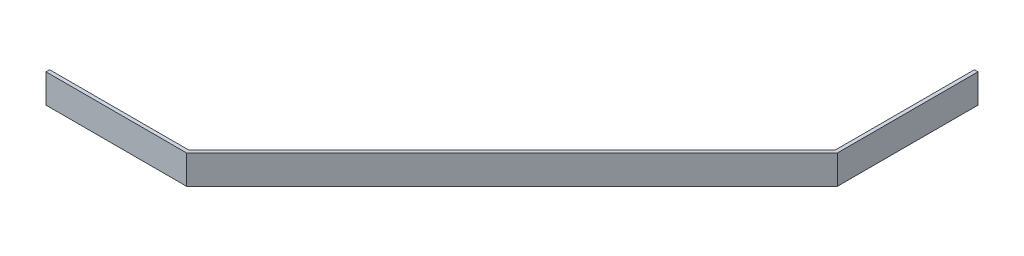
ISO-10303-21;
HEADER;
FILE_DESCRIPTION(('STEP AP214'),'2;1');
FILE_NAME('part.step','',(''),(''),'','','');
FILE_SCHEMA(('AUTOMOTIVE_DESIGN { 1 0 10303 214 1 1 1 1 }'));
ENDSEC;
DATA;
#1=APPLICATION_CONTEXT('core data for automotive mechanical design processes');
#2=APPLICATION_PROTOCOL_DEFINITION('international standard','automotive_design',2000,#1);
#3=PRODUCT_CONTEXT('',#1,'mechanical');
#4=PRODUCT('Part','Part','',(#3));
#5=PRODUCT_RELATED_PRODUCT_CATEGORY('part','',(#4));
#6=PRODUCT_DEFINITION_FORMATION('','',#4);
#7=PRODUCT_DEFINITION_CONTEXT('part definition',#1,'design');
#8=PRODUCT_DEFINITION('design','',#6,#7);
#9=PRODUCT_DEFINITION_SHAPE('','',#8);
#10=(LENGTH_UNIT() NAMED_UNIT(*) SI_UNIT(.MILLI.,.METRE.));
#11=(NAMED_UNIT(*) PLANE_ANGLE_UNIT() SI_UNIT($,.RADIAN.));
#12=(NAMED_UNIT(*) SI_UNIT($,.STERADIAN.) SOLID_ANGLE_UNIT());
#13=UNCERTAINTY_MEASURE_WITH_UNIT(LENGTH_MEASURE(1.E-05),#10,'distance_accuracy_value','');
#14=(GEOMETRIC_REPRESENTATION_CONTEXT(3) GLOBAL_UNCERTAINTY_ASSIGNED_CONTEXT((#13)) GLOBAL_UNIT_ASSIGNED_CONTEXT((#10,
#11,#12)) REPRESENTATION_CONTEXT('',''));
#15=CARTESIAN_POINT('',(0.,0.,0.));
#16=DIRECTION('',(0.,0.,1.));
#17=DIRECTION('',(1.,0.,0.));
#18=AXIS2_PLACEMENT_3D('',#15,#16,#17);
#19=CARTESIAN_POINT('',(0.,76.2,0.));
#20=DIRECTION('',(1.,0.,0.));
#21=DIRECTION('',(0.,0.,-1.));
#22=AXIS2_PLACEMENT_3D('',#19,#20,#21);
#23=PLANE('',#22);
#24=DIRECTION('',(0.,0.,1.));
#25=VECTOR('',#24,1.);
#26=CARTESIAN_POINT('',(0.,0.,0.));
#27=LINE('',#26,#25);
#28=CARTESIAN_POINT('',(0.,0.,0.));
#29=VERTEX_POINT('',#28);
#30=CARTESIAN_POINT('',(0.,0.,9.525));
#31=VERTEX_POINT('',#30);
#32=EDGE_CURVE('E129',#29,#31,#27,.T.);
#33=ORIENTED_EDGE('',*,*,#32,.T.);
#34=DIRECTION('',(0.,-1.,0.));
#35=VECTOR('',#34,1.);
#36=CARTESIAN_POINT('',(0.,76.2,9.525));
#37=LINE('',#36,#35);
#38=CARTESIAN_POINT('',(0.,76.2,9.525));
#39=VERTEX_POINT('',#38);
#40=EDGE_CURVE('E11',#39,#31,#37,.T.);
#41=ORIENTED_EDGE('',*,*,#40,.F.);
#42=DIRECTION('',(0.,0.,1.));
#43=VECTOR('',#42,1.);
#44=CARTESIAN_POINT('',(0.,76.2,0.));
#45=LINE('',#44,#43);
#46=CARTESIAN_POINT('',(0.,76.2,0.));
#47=VERTEX_POINT('',#46);
#48=EDGE_CURVE('E143',#47,#39,#45,.T.);
#49=ORIENTED_EDGE('',*,*,#48,.F.);
#50=DIRECTION('',(0.,-1.,0.));
#51=VECTOR('',#50,1.);
#52=CARTESIAN_POINT('',(0.,76.2,0.));
#53=LINE('',#52,#51);
#54=EDGE_CURVE('E125',#47,#29,#53,.T.);
#55=ORIENTED_EDGE('',*,*,#54,.T.);
#56=EDGE_LOOP('',(#33,#41,#49,#55));
#57=FACE_BOUND('',#56,.T.);
#58=ADVANCED_FACE('F33',(#57),#23,.F.);
#59=CARTESIAN_POINT('',(0.,76.2,9.525));
#60=DIRECTION('',(0.,0.,-1.));
#61=DIRECTION('',(-1.,0.,0.));
#62=AXIS2_PLACEMENT_3D('',#59,#60,#61);
#63=PLANE('',#62);
#64=DIRECTION('',(1.,0.,0.));
#65=VECTOR('',#64,1.);
#66=CARTESIAN_POINT('',(0.,0.,9.525));
#67=LINE('',#66,#65);
#68=CARTESIAN_POINT('',(370.657884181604,0.,9.52500000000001));
#69=VERTEX_POINT('',#68);
#70=EDGE_CURVE('E132',#31,#69,#67,.T.);
#71=ORIENTED_EDGE('',*,*,#70,.T.);
#72=DIRECTION('',(0.,-1.,0.));
#73=VECTOR('',#72,1.);
#74=CARTESIAN_POINT('',(370.657884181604,76.2,9.52500000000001));
#75=LINE('',#74,#73);
#76=CARTESIAN_POINT('',(370.657884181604,76.2,9.52500000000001));
#77=VERTEX_POINT('',#76);
#78=EDGE_CURVE('E41',#77,#69,#75,.T.);
#79=ORIENTED_EDGE('',*,*,#78,.F.);
#80=DIRECTION('',(1.,0.,0.));
#81=VECTOR('',#80,1.);
#82=CARTESIAN_POINT('',(0.,76.2,9.525));
#83=LINE('',#82,#81);
#84=EDGE_CURVE('E92',#39,#77,#83,.T.);
#85=ORIENTED_EDGE('',*,*,#84,.F.);
#86=ORIENTED_EDGE('',*,*,#40,.T.);
#87=EDGE_LOOP('',(#71,#79,#85,#86));
#88=FACE_BOUND('',#87,.T.);
#89=ADVANCED_FACE('F178',(#88),#63,.F.);
#90=CARTESIAN_POINT('',(370.657884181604,76.2,9.52500000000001));
#91=DIRECTION('',(-0.707106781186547,0.,-0.707106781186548));
#92=DIRECTION('',(-0.707106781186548,0.,0.707106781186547));
#93=AXIS2_PLACEMENT_3D('',#90,#91,#92);
#94=PLANE('',#93);
#95=DIRECTION('',(0.707106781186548,0.,-0.707106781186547));
#96=VECTOR('',#95,1.);
#97=CARTESIAN_POINT('',(370.657884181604,0.,9.52500000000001));
#98=LINE('',#97,#96);
#99=CARTESIAN_POINT('',(1228.725,0.,-848.542115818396));
#100=VERTEX_POINT('',#99);
#101=EDGE_CURVE('E134',#69,#100,#98,.T.);
#102=ORIENTED_EDGE('',*,*,#101,.T.);
#103=DIRECTION('',(0.,-1.,0.));
#104=VECTOR('',#103,1.);
#105=CARTESIAN_POINT('',(1228.725,76.2,-848.542115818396));
#106=LINE('',#105,#104);
#107=CARTESIAN_POINT('',(1228.725,76.2,-848.542115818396));
#108=VERTEX_POINT('',#107);
#109=EDGE_CURVE('E150',#108,#100,#106,.T.);
#110=ORIENTED_EDGE('',*,*,#109,.F.);
#111=DIRECTION('',(0.707106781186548,0.,-0.707106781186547));
#112=VECTOR('',#111,1.);
#113=CARTESIAN_POINT('',(370.657884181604,76.2,9.52500000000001));
#114=LINE('',#113,#112);
#115=EDGE_CURVE('E158',#77,#108,#114,.T.);
#116=ORIENTED_EDGE('',*,*,#115,.F.);
#117=ORIENTED_EDGE('',*,*,#78,.T.);
#118=EDGE_LOOP('',(#102,#110,#116,#117));
#119=FACE_BOUND('',#118,.T.);
#120=ADVANCED_FACE('F156',(#119),#94,.F.);
#121=CARTESIAN_POINT('',(1228.725,76.2,-848.542115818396));
#122=DIRECTION('',(-1.,0.,0.));
#123=DIRECTION('',(0.,0.,1.));
#124=AXIS2_PLACEMENT_3D('',#121,#122,#123);
#125=PLANE('',#124);
#126=DIRECTION('',(0.,0.,-1.));
#127=VECTOR('',#126,1.);
#128=CARTESIAN_POINT('',(1228.725,0.,-848.542115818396));
#129=LINE('',#128,#127);
#130=CARTESIAN_POINT('',(1228.725,0.,-1219.2));
#131=VERTEX_POINT('',#130);
#132=EDGE_CURVE('E136',#100,#131,#129,.T.);
#133=ORIENTED_EDGE('',*,*,#132,.T.);
#134=DIRECTION('',(0.,-1.,0.));
#135=VECTOR('',#134,1.);
#136=CARTESIAN_POINT('',(1228.725,76.2,-1219.2));
#137=LINE('',#136,#135);
#138=CARTESIAN_POINT('',(1228.725,76.2,-1219.2));
#139=VERTEX_POINT('',#138);
#140=EDGE_CURVE('E147',#139,#131,#137,.T.);
#141=ORIENTED_EDGE('',*,*,#140,.F.);
#142=DIRECTION('',(0.,0.,-1.));
#143=VECTOR('',#142,1.);
#144=CARTESIAN_POINT('',(1228.725,76.2,-848.542115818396));
#145=LINE('',#144,#143);
#146=EDGE_CURVE('E170',#108,#139,#145,.T.);
#147=ORIENTED_EDGE('',*,*,#146,.F.);
#148=ORIENTED_EDGE('',*,*,#109,.T.);
#149=EDGE_LOOP('',(#133,#141,#147,#148));
#150=FACE_BOUND('',#149,.T.);
#151=ADVANCED_FACE('F166',(#150),#125,.F.);
#152=CARTESIAN_POINT('',(1219.2,76.2,-1219.2));
#153=DIRECTION('',(0.,0.,1.));
#154=DIRECTION('',(1.,0.,0.));
#155=AXIS2_PLACEMENT_3D('',#152,#153,#154);
#156=PLANE('',#155);
#157=DIRECTION('',(-1.,0.,0.));
#158=VECTOR('',#157,1.);
#159=CARTESIAN_POINT('',(1219.2,0.,-1219.2));
#160=LINE('',#159,#158);
#161=CARTESIAN_POINT('',(1219.2,0.,-1219.2));
#162=VERTEX_POINT('',#161);
#163=EDGE_CURVE('E138',#131,#162,#160,.T.);
#164=ORIENTED_EDGE('',*,*,#163,.T.);
#165=DIRECTION('',(0.,-1.,0.));
#166=VECTOR('',#165,1.);
#167=CARTESIAN_POINT('',(1219.2,76.2,-1219.2));
#168=LINE('',#167,#166);
#169=CARTESIAN_POINT('',(1219.2,76.2,-1219.2));
#170=VERTEX_POINT('',#169);
#171=EDGE_CURVE('E120',#170,#162,#168,.T.);
#172=ORIENTED_EDGE('',*,*,#171,.F.);
#173=DIRECTION('',(-1.,0.,0.));
#174=VECTOR('',#173,1.);
#175=CARTESIAN_POINT('',(1219.2,76.2,-1219.2));
#176=LINE('',#175,#174);
#177=EDGE_CURVE('E111',#139,#170,#176,.T.);
#178=ORIENTED_EDGE('',*,*,#177,.F.);
#179=ORIENTED_EDGE('',*,*,#140,.T.);
#180=EDGE_LOOP('',(#164,#172,#178,#179));
#181=FACE_BOUND('',#180,.T.);
#182=ADVANCED_FACE('F169',(#181),#156,.F.);
#183=CARTESIAN_POINT('',(1219.2,76.2,-852.4875));
#184=DIRECTION('',(1.,0.,0.));
#185=DIRECTION('',(0.,0.,-1.));
#186=AXIS2_PLACEMENT_3D('',#183,#184,#185);
#187=PLANE('',#186);
#188=DIRECTION('',(0.,0.,1.));
#189=VECTOR('',#188,1.);
#190=CARTESIAN_POINT('',(1219.2,0.,-852.4875));
#191=LINE('',#190,#189);
#192=CARTESIAN_POINT('',(1219.2,0.,-852.4875));
#193=VERTEX_POINT('',#192);
#194=EDGE_CURVE('E119',#162,#193,#191,.T.);
#195=ORIENTED_EDGE('',*,*,#194,.T.);
#196=DIRECTION('',(0.,-1.,0.));
#197=VECTOR('',#196,1.);
#198=CARTESIAN_POINT('',(1219.2,76.2,-852.4875));
#199=LINE('',#198,#197);
#200=CARTESIAN_POINT('',(1219.2,76.2,-852.4875));
#201=VERTEX_POINT('',#200);
#202=EDGE_CURVE('E116',#201,#193,#199,.T.);
#203=ORIENTED_EDGE('',*,*,#202,.F.);
#204=DIRECTION('',(0.,0.,1.));
#205=VECTOR('',#204,1.);
#206=CARTESIAN_POINT('',(1219.2,76.2,-852.4875));
#207=LINE('',#206,#205);
#208=EDGE_CURVE('E105',#170,#201,#207,.T.);
#209=ORIENTED_EDGE('',*,*,#208,.F.);
#210=ORIENTED_EDGE('',*,*,#171,.T.);
#211=EDGE_LOOP('',(#195,#203,#209,#210));
#212=FACE_BOUND('',#211,.T.);
#213=ADVANCED_FACE('F117',(#212),#187,.F.);
#214=CARTESIAN_POINT('',(366.7125,76.2,0.));
#215=DIRECTION('',(0.707106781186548,0.,0.707106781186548));
#216=DIRECTION('',(0.707106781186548,0.,-0.707106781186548));
#217=AXIS2_PLACEMENT_3D('',#214,#215,#216);
#218=PLANE('',#217);
#219=DIRECTION('',(-0.707106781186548,0.,0.707106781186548));
#220=VECTOR('',#219,1.);
#221=CARTESIAN_POINT('',(366.7125,0.,0.));
#222=LINE('',#221,#220);
#223=CARTESIAN_POINT('',(366.7125,0.,0.));
#224=VERTEX_POINT('',#223);
#225=EDGE_CURVE('E78',#193,#224,#222,.T.);
#226=ORIENTED_EDGE('',*,*,#225,.T.);
#227=DIRECTION('',(0.,-1.,0.));
#228=VECTOR('',#227,1.);
#229=CARTESIAN_POINT('',(366.7125,76.2,0.));
#230=LINE('',#229,#228);
#231=CARTESIAN_POINT('',(366.7125,76.2,0.));
#232=VERTEX_POINT('',#231);
#233=EDGE_CURVE('E121',#232,#224,#230,.T.);
#234=ORIENTED_EDGE('',*,*,#233,.F.);
#235=DIRECTION('',(-0.707106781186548,0.,0.707106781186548));
#236=VECTOR('',#235,1.);
#237=CARTESIAN_POINT('',(366.7125,76.2,0.));
#238=LINE('',#237,#236);
#239=EDGE_CURVE('E109',#201,#232,#238,.T.);
#240=ORIENTED_EDGE('',*,*,#239,.F.);
#241=ORIENTED_EDGE('',*,*,#202,.T.);
#242=EDGE_LOOP('',(#226,#234,#240,#241));
#243=FACE_BOUND('',#242,.T.);
#244=ADVANCED_FACE('F123',(#243),#218,.F.);
#245=CARTESIAN_POINT('',(0.,76.2,0.));
#246=DIRECTION('',(0.,0.,1.));
#247=DIRECTION('',(1.,0.,0.));
#248=AXIS2_PLACEMENT_3D('',#245,#246,#247);
#249=PLANE('',#248);
#250=DIRECTION('',(-1.,0.,0.));
#251=VECTOR('',#250,1.);
#252=CARTESIAN_POINT('',(0.,0.,0.));
#253=LINE('',#252,#251);
#254=EDGE_CURVE('E84',#224,#29,#253,.T.);
#255=ORIENTED_EDGE('',*,*,#254,.T.);
#256=ORIENTED_EDGE('',*,*,#54,.F.);
#257=DIRECTION('',(-1.,0.,0.));
#258=VECTOR('',#257,1.);
#259=CARTESIAN_POINT('',(0.,76.2,0.));
#260=LINE('',#259,#258);
#261=EDGE_CURVE('E49',#232,#47,#260,.T.);
#262=ORIENTED_EDGE('',*,*,#261,.F.);
#263=ORIENTED_EDGE('',*,*,#233,.T.);
#264=EDGE_LOOP('',(#255,#256,#262,#263));
#265=FACE_BOUND('',#264,.T.);
#266=ADVANCED_FACE('F194',(#265),#249,.F.);
#267=CARTESIAN_POINT('',(0.,76.2,0.));
#268=DIRECTION('',(0.,1.,0.));
#269=DIRECTION('',(0.,0.,1.));
#270=AXIS2_PLACEMENT_3D('',#267,#268,#269);
#271=PLANE('',#270);
#272=ORIENTED_EDGE('',*,*,#48,.T.);
#273=ORIENTED_EDGE('',*,*,#84,.T.);
#274=ORIENTED_EDGE('',*,*,#115,.T.);
#275=ORIENTED_EDGE('',*,*,#146,.T.);
#276=ORIENTED_EDGE('',*,*,#177,.T.);
#277=ORIENTED_EDGE('',*,*,#208,.T.);
#278=ORIENTED_EDGE('',*,*,#239,.T.);
#279=ORIENTED_EDGE('',*,*,#261,.T.);
#280=EDGE_LOOP('',(#272,#273,#274,#275,#276,#277,#278,#279));
#281=FACE_BOUND('',#280,.T.);
#282=ADVANCED_FACE('F107',(#281),#271,.T.);
#283=CARTESIAN_POINT('',(0.,0.,0.));
#284=DIRECTION('',(0.,1.,0.));
#285=DIRECTION('',(0.,0.,1.));
#286=AXIS2_PLACEMENT_3D('',#283,#284,#285);
#287=PLANE('',#286);
#288=ORIENTED_EDGE('',*,*,#32,.F.);
#289=ORIENTED_EDGE('',*,*,#254,.F.);
#290=ORIENTED_EDGE('',*,*,#225,.F.);
#291=ORIENTED_EDGE('',*,*,#194,.F.);
#292=ORIENTED_EDGE('',*,*,#163,.F.);
#293=ORIENTED_EDGE('',*,*,#132,.F.);
#294=ORIENTED_EDGE('',*,*,#101,.F.);
#295=ORIENTED_EDGE('',*,*,#70,.F.);
#296=EDGE_LOOP('',(#288,#289,#290,#291,#292,#293,#294,#295));
#297=FACE_BOUND('',#296,.T.);
#298=ADVANCED_FACE('F162',(#297),#287,.F.);
#299=CLOSED_SHELL('',(#58,#89,#120,#151,#182,#213,#244,#266,#282,#298));
#300=MANIFOLD_SOLID_BREP('B2',#299);
#301=ADVANCED_BREP_SHAPE_REPRESENTATION('',(#18,#300),#14);
#302=SHAPE_DEFINITION_REPRESENTATION(#9,#301);
ENDSEC;
END-ISO-10303-21;
